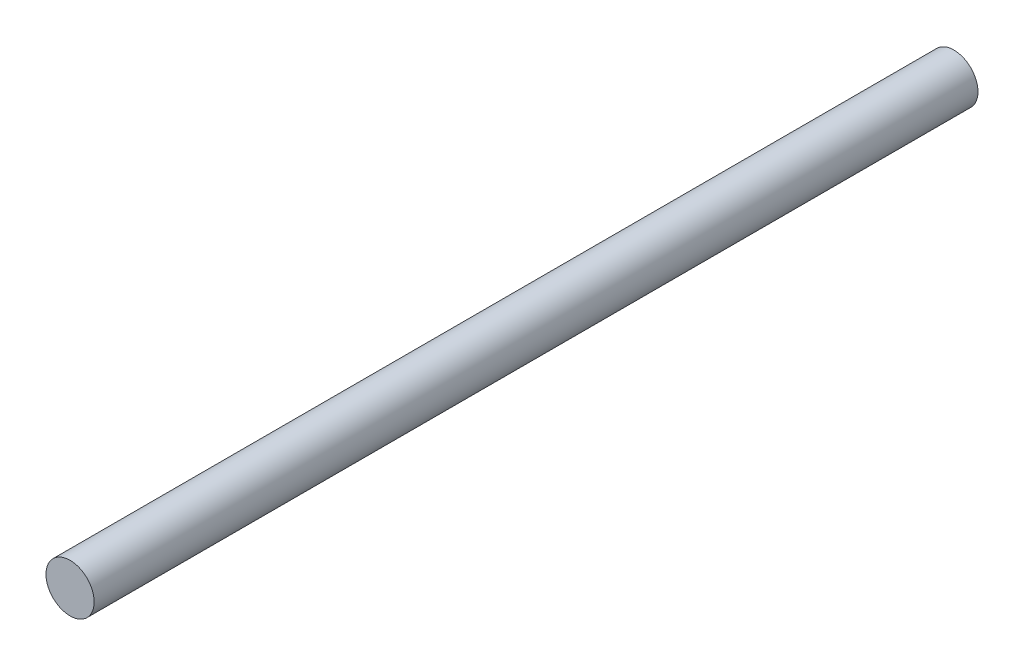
from build123d import *

# Parameters (mm, degrees)
SKETCH1_R           = 30
BOSS_EXTRUDE1_DEPTH = 1100


with BuildPart() as part:
    # Sketch1 → Boss-Extrude1 (new body)
    with BuildSketch(Plane.XY):
        Circle(SKETCH1_R)
    extrude(amount=-BOSS_EXTRUDE1_DEPTH)


solid = part.part
